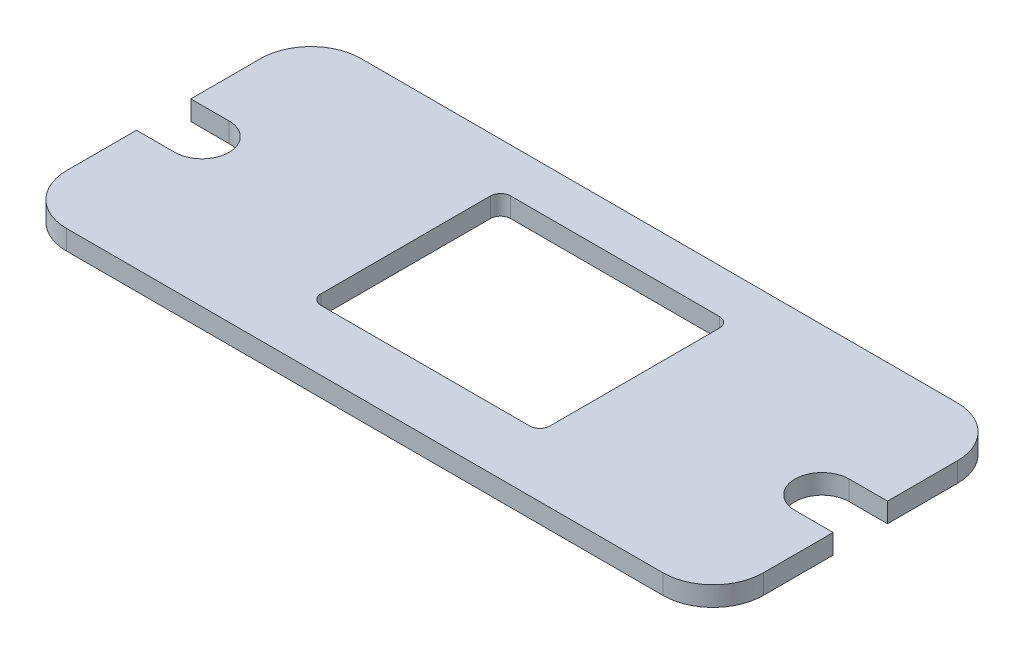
ISO-10303-21;
HEADER;
FILE_DESCRIPTION(('STEP AP214'),'2;1');
FILE_NAME('part.step','',(''),(''),'','','');
FILE_SCHEMA(('AUTOMOTIVE_DESIGN { 1 0 10303 214 1 1 1 1 }'));
ENDSEC;
DATA;
#1=APPLICATION_CONTEXT('core data for automotive mechanical design processes');
#2=APPLICATION_PROTOCOL_DEFINITION('international standard','automotive_design',2000,#1);
#3=PRODUCT_CONTEXT('',#1,'mechanical');
#4=PRODUCT('Part','Part','',(#3));
#5=PRODUCT_RELATED_PRODUCT_CATEGORY('part','',(#4));
#6=PRODUCT_DEFINITION_FORMATION('','',#4);
#7=PRODUCT_DEFINITION_CONTEXT('part definition',#1,'design');
#8=PRODUCT_DEFINITION('design','',#6,#7);
#9=PRODUCT_DEFINITION_SHAPE('','',#8);
#10=(LENGTH_UNIT() NAMED_UNIT(*) SI_UNIT(.MILLI.,.METRE.));
#11=(NAMED_UNIT(*) PLANE_ANGLE_UNIT() SI_UNIT($,.RADIAN.));
#12=(NAMED_UNIT(*) SI_UNIT($,.STERADIAN.) SOLID_ANGLE_UNIT());
#13=UNCERTAINTY_MEASURE_WITH_UNIT(LENGTH_MEASURE(1.E-05),#10,'distance_accuracy_value','');
#14=(GEOMETRIC_REPRESENTATION_CONTEXT(3) GLOBAL_UNCERTAINTY_ASSIGNED_CONTEXT((#13)) GLOBAL_UNIT_ASSIGNED_CONTEXT((#10,
#11,#12)) REPRESENTATION_CONTEXT('',''));
#15=CARTESIAN_POINT('',(0.,0.,0.));
#16=DIRECTION('',(0.,0.,1.));
#17=DIRECTION('',(1.,0.,0.));
#18=AXIS2_PLACEMENT_3D('',#15,#16,#17);
#19=CARTESIAN_POINT('',(27.051,1.52400000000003,-11.43));
#20=DIRECTION('',(-1.,0.,0.));
#21=DIRECTION('',(0.,0.,1.));
#22=AXIS2_PLACEMENT_3D('',#19,#20,#21);
#23=PLANE('',#22);
#24=DIRECTION('',(0.,0.,-1.));
#25=VECTOR('',#24,1.);
#26=CARTESIAN_POINT('',(27.051,0.,-11.43));
#27=LINE('',#26,#25);
#28=CARTESIAN_POINT('',(27.051,0.,-2.1082));
#29=VERTEX_POINT('',#28);
#30=CARTESIAN_POINT('',(27.051,0.,-7.5311));
#31=VERTEX_POINT('',#30);
#32=EDGE_CURVE('E269',#29,#31,#27,.T.);
#33=ORIENTED_EDGE('',*,*,#32,.T.);
#34=DIRECTION('',(0.,-1.,0.));
#35=VECTOR('',#34,1.);
#36=CARTESIAN_POINT('',(27.051,1.524,-7.5311));
#37=LINE('',#36,#35);
#38=CARTESIAN_POINT('',(27.051,1.524,-7.5311));
#39=VERTEX_POINT('',#38);
#40=EDGE_CURVE('E333',#31,#39,#37,.F.);
#41=ORIENTED_EDGE('',*,*,#40,.T.);
#42=DIRECTION('',(0.,0.,-1.));
#43=VECTOR('',#42,1.);
#44=CARTESIAN_POINT('',(27.051,1.52400000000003,-11.43));
#45=LINE('',#44,#43);
#46=CARTESIAN_POINT('',(27.051,1.524,-2.10819999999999));
#47=VERTEX_POINT('',#46);
#48=EDGE_CURVE('E279',#47,#39,#45,.T.);
#49=ORIENTED_EDGE('',*,*,#48,.F.);
#50=DIRECTION('',(0.,1.,0.));
#51=VECTOR('',#50,1.);
#52=CARTESIAN_POINT('',(27.051,0.,-2.1082));
#53=LINE('',#52,#51);
#54=EDGE_CURVE('E246',#29,#47,#53,.T.);
#55=ORIENTED_EDGE('',*,*,#54,.F.);
#56=EDGE_LOOP('',(#33,#41,#49,#55));
#57=FACE_BOUND('',#56,.T.);
#58=ADVANCED_FACE('F44',(#57),#23,.F.);
#59=CARTESIAN_POINT('',(-27.051,1.52400000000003,-11.43));
#60=DIRECTION('',(1.,0.,0.));
#61=DIRECTION('',(0.,0.,-1.));
#62=AXIS2_PLACEMENT_3D('',#59,#60,#61);
#63=PLANE('',#62);
#64=DIRECTION('',(0.,0.,1.));
#65=VECTOR('',#64,1.);
#66=CARTESIAN_POINT('',(-27.051,0.,-11.4300000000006));
#67=LINE('',#66,#65);
#68=CARTESIAN_POINT('',(-27.051,2.77555756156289E-13,2.10819999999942));
#69=VERTEX_POINT('',#68);
#70=CARTESIAN_POINT('',(-27.0510000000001,2.4980018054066E-13,7.53109999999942));
#71=VERTEX_POINT('',#70);
#72=EDGE_CURVE('E292',#69,#71,#67,.T.);
#73=ORIENTED_EDGE('',*,*,#72,.T.);
#74=DIRECTION('',(0.,-1.,0.));
#75=VECTOR('',#74,1.);
#76=CARTESIAN_POINT('',(-27.051,1.52400000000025,7.5311));
#77=LINE('',#76,#75);
#78=CARTESIAN_POINT('',(-27.051,1.52400000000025,7.5311));
#79=VERTEX_POINT('',#78);
#80=EDGE_CURVE('E313',#71,#79,#77,.F.);
#81=ORIENTED_EDGE('',*,*,#80,.T.);
#82=DIRECTION('',(0.,0.,1.));
#83=VECTOR('',#82,1.);
#84=CARTESIAN_POINT('',(-27.051,1.52400000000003,-11.43));
#85=LINE('',#84,#83);
#86=CARTESIAN_POINT('',(-27.0509999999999,1.52400000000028,2.1082));
#87=VERTEX_POINT('',#86);
#88=EDGE_CURVE('E281',#87,#79,#85,.T.);
#89=ORIENTED_EDGE('',*,*,#88,.F.);
#90=DIRECTION('',(0.,1.,0.));
#91=VECTOR('',#90,1.);
#92=CARTESIAN_POINT('',(-27.051,2.77555756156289E-13,2.10819999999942));
#93=LINE('',#92,#91);
#94=EDGE_CURVE('E270',#69,#87,#93,.T.);
#95=ORIENTED_EDGE('',*,*,#94,.F.);
#96=EDGE_LOOP('',(#73,#81,#89,#95));
#97=FACE_BOUND('',#96,.T.);
#98=ADVANCED_FACE('F425',(#97),#63,.F.);
#99=CARTESIAN_POINT('',(27.051,1.52400000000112,7.5311));
#100=VERTEX_POINT('',#99);
#101=CARTESIAN_POINT('',(27.051,1.5240000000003,2.1082));
#102=VERTEX_POINT('',#101);
#103=EDGE_CURVE('E276',#100,#102,#45,.T.);
#104=ORIENTED_EDGE('',*,*,#103,.F.);
#105=DIRECTION('',(0.,-1.,0.));
#106=VECTOR('',#105,1.);
#107=CARTESIAN_POINT('',(27.051,1.52400000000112,7.5311));
#108=LINE('',#107,#106);
#109=CARTESIAN_POINT('',(27.051,1.12410081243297E-12,7.5311));
#110=VERTEX_POINT('',#109);
#111=EDGE_CURVE('E317',#100,#110,#108,.T.);
#112=ORIENTED_EDGE('',*,*,#111,.T.);
#113=CARTESIAN_POINT('',(27.051,3.05311331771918E-13,2.1082));
#114=VERTEX_POINT('',#113);
#115=EDGE_CURVE('E288',#110,#114,#27,.T.);
#116=ORIENTED_EDGE('',*,*,#115,.T.);
#117=DIRECTION('',(0.,1.,0.));
#118=VECTOR('',#117,1.);
#119=CARTESIAN_POINT('',(27.051,3.05311331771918E-13,2.1082));
#120=LINE('',#119,#118);
#121=EDGE_CURVE('E217',#114,#102,#120,.T.);
#122=ORIENTED_EDGE('',*,*,#121,.T.);
#123=EDGE_LOOP('',(#104,#112,#116,#122));
#124=FACE_BOUND('',#123,.T.);
#125=ADVANCED_FACE('F428',(#124),#23,.F.);
#126=CARTESIAN_POINT('',(-27.051,1.52400000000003,-11.43));
#127=DIRECTION('',(0.,0.,1.));
#128=DIRECTION('',(1.,0.,0.));
#129=AXIS2_PLACEMENT_3D('',#126,#127,#128);
#130=PLANE('',#129);
#131=DIRECTION('',(-1.,0.,0.));
#132=VECTOR('',#131,1.);
#133=CARTESIAN_POINT('',(-27.051,1.52400000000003,-11.43));
#134=LINE('',#133,#132);
#135=CARTESIAN_POINT('',(23.1521,1.52400000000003,-11.43));
#136=VERTEX_POINT('',#135);
#137=CARTESIAN_POINT('',(-23.1521,1.52400000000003,-11.43));
#138=VERTEX_POINT('',#137);
#139=EDGE_CURVE('E278',#136,#138,#134,.T.);
#140=ORIENTED_EDGE('',*,*,#139,.F.);
#141=DIRECTION('',(0.,-1.,0.));
#142=VECTOR('',#141,1.);
#143=CARTESIAN_POINT('',(23.1521,1.52400000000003,-11.43));
#144=LINE('',#143,#142);
#145=CARTESIAN_POINT('',(23.1521,0.,-11.43));
#146=VERTEX_POINT('',#145);
#147=EDGE_CURVE('E330',#136,#146,#144,.T.);
#148=ORIENTED_EDGE('',*,*,#147,.T.);
#149=DIRECTION('',(-1.,0.,0.));
#150=VECTOR('',#149,1.);
#151=CARTESIAN_POINT('',(-27.051,0.,-11.4300000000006));
#152=LINE('',#151,#150);
#153=CARTESIAN_POINT('',(-23.1521,0.,-11.4300000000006));
#154=VERTEX_POINT('',#153);
#155=EDGE_CURVE('E290',#146,#154,#152,.T.);
#156=ORIENTED_EDGE('',*,*,#155,.T.);
#157=DIRECTION('',(0.,-1.,0.));
#158=VECTOR('',#157,1.);
#159=CARTESIAN_POINT('',(-23.1521,1.52400000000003,-11.43));
#160=LINE('',#159,#158);
#161=EDGE_CURVE('E303',#154,#138,#160,.F.);
#162=ORIENTED_EDGE('',*,*,#161,.T.);
#163=EDGE_LOOP('',(#140,#148,#156,#162));
#164=FACE_BOUND('',#163,.T.);
#165=ADVANCED_FACE('F439',(#164),#130,.F.);
#166=CARTESIAN_POINT('',(-27.051,1.524,-7.5311));
#167=VERTEX_POINT('',#166);
#168=CARTESIAN_POINT('',(-27.051,1.524,-2.10819999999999));
#169=VERTEX_POINT('',#168);
#170=EDGE_CURVE('E282',#167,#169,#85,.T.);
#171=ORIENTED_EDGE('',*,*,#170,.F.);
#172=DIRECTION('',(0.,-1.,0.));
#173=VECTOR('',#172,1.);
#174=CARTESIAN_POINT('',(-27.051,1.524,-7.5311));
#175=LINE('',#174,#173);
#176=CARTESIAN_POINT('',(-27.051,0.,-7.53110000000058));
#177=VERTEX_POINT('',#176);
#178=EDGE_CURVE('E287',#167,#177,#175,.T.);
#179=ORIENTED_EDGE('',*,*,#178,.T.);
#180=CARTESIAN_POINT('',(-27.0510000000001,0.,-2.10820000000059));
#181=VERTEX_POINT('',#180);
#182=EDGE_CURVE('E293',#177,#181,#67,.T.);
#183=ORIENTED_EDGE('',*,*,#182,.T.);
#184=DIRECTION('',(0.,1.,0.));
#185=VECTOR('',#184,1.);
#186=CARTESIAN_POINT('',(-27.0510000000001,0.,-2.10820000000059));
#187=LINE('',#186,#185);
#188=EDGE_CURVE('E272',#181,#169,#187,.T.);
#189=ORIENTED_EDGE('',*,*,#188,.T.);
#190=EDGE_LOOP('',(#171,#179,#183,#189));
#191=FACE_BOUND('',#190,.T.);
#192=ADVANCED_FACE('F434',(#191),#63,.F.);
#193=CARTESIAN_POINT('',(-27.051,1.52400000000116,11.43));
#194=DIRECTION('',(0.,0.,-1.));
#195=DIRECTION('',(-1.,0.,0.));
#196=AXIS2_PLACEMENT_3D('',#193,#194,#195);
#197=PLANE('',#196);
#198=DIRECTION('',(1.,0.,0.));
#199=VECTOR('',#198,1.);
#200=CARTESIAN_POINT('',(-27.0510000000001,1.16573417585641E-12,11.4299999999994));
#201=LINE('',#200,#199);
#202=CARTESIAN_POINT('',(-23.1521000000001,1.16573417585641E-12,11.4299999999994));
#203=VERTEX_POINT('',#202);
#204=CARTESIAN_POINT('',(23.1521,1.20736753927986E-12,11.43));
#205=VERTEX_POINT('',#204);
#206=EDGE_CURVE('E295',#203,#205,#201,.T.);
#207=ORIENTED_EDGE('',*,*,#206,.T.);
#208=DIRECTION('',(0.,-1.,0.));
#209=VECTOR('',#208,1.);
#210=CARTESIAN_POINT('',(23.1521,1.5240000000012,11.43));
#211=LINE('',#210,#209);
#212=CARTESIAN_POINT('',(23.1521,1.5240000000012,11.43));
#213=VERTEX_POINT('',#212);
#214=EDGE_CURVE('E324',#205,#213,#211,.F.);
#215=ORIENTED_EDGE('',*,*,#214,.T.);
#216=DIRECTION('',(1.,0.,0.));
#217=VECTOR('',#216,1.);
#218=CARTESIAN_POINT('',(-27.051,1.52400000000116,11.43));
#219=LINE('',#218,#217);
#220=CARTESIAN_POINT('',(-23.1521,1.52400000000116,11.43));
#221=VERTEX_POINT('',#220);
#222=EDGE_CURVE('E284',#221,#213,#219,.T.);
#223=ORIENTED_EDGE('',*,*,#222,.F.);
#224=DIRECTION('',(0.,-1.,0.));
#225=VECTOR('',#224,1.);
#226=CARTESIAN_POINT('',(-23.1521,1.52400000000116,11.43));
#227=LINE('',#226,#225);
#228=EDGE_CURVE('E308',#221,#203,#227,.T.);
#229=ORIENTED_EDGE('',*,*,#228,.T.);
#230=EDGE_LOOP('',(#207,#215,#223,#229));
#231=FACE_BOUND('',#230,.T.);
#232=ADVANCED_FACE('F453',(#231),#197,.F.);
#233=CARTESIAN_POINT('',(1.38777878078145E-13,1.524,0.));
#234=DIRECTION('',(0.,1.,0.));
#235=DIRECTION('',(0.,0.,1.));
#236=AXIS2_PLACEMENT_3D('',#233,#234,#235);
#237=PLANE('',#236);
#238=DIRECTION('',(0.,0.,-1.));
#239=VECTOR('',#238,1.);
#240=CARTESIAN_POINT('',(8.89,1.524,6.731));
#241=LINE('',#240,#239);
#242=CARTESIAN_POINT('',(8.89,1.524,5.94359999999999));
#243=VERTEX_POINT('',#242);
#244=CARTESIAN_POINT('',(8.89000000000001,1.524,-7.2136));
#245=VERTEX_POINT('',#244);
#246=EDGE_CURVE('E377',#243,#245,#241,.T.);
#247=ORIENTED_EDGE('',*,*,#246,.F.);
#248=CARTESIAN_POINT('',(8.1026,1.524,5.94359999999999));
#249=DIRECTION('',(0.,1.,0.));
#250=DIRECTION('',(0.,0.,1.));
#251=AXIS2_PLACEMENT_3D('',#248,#249,#250);
#252=CIRCLE('',#251,0.7874);
#253=CARTESIAN_POINT('',(8.1026,1.52400000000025,6.731));
#254=VERTEX_POINT('',#253);
#255=EDGE_CURVE('E354',#243,#254,#252,.F.);
#256=ORIENTED_EDGE('',*,*,#255,.T.);
#257=DIRECTION('',(1.,0.,0.));
#258=VECTOR('',#257,1.);
#259=CARTESIAN_POINT('',(-8.89,1.524,6.731));
#260=LINE('',#259,#258);
#261=CARTESIAN_POINT('',(-8.10259999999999,1.524,6.731));
#262=VERTEX_POINT('',#261);
#263=EDGE_CURVE('E236',#262,#254,#260,.T.);
#264=ORIENTED_EDGE('',*,*,#263,.F.);
#265=CARTESIAN_POINT('',(-8.10259999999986,1.52400000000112,5.94359999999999));
#266=DIRECTION('',(0.,1.,0.));
#267=DIRECTION('',(0.,0.,1.));
#268=AXIS2_PLACEMENT_3D('',#265,#266,#267);
#269=CIRCLE('',#268,0.7874);
#270=CARTESIAN_POINT('',(-8.88999999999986,1.524,5.94359999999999));
#271=VERTEX_POINT('',#270);
#272=EDGE_CURVE('E358',#262,#271,#269,.F.);
#273=ORIENTED_EDGE('',*,*,#272,.T.);
#274=DIRECTION('',(0.,0.,1.));
#275=VECTOR('',#274,1.);
#276=CARTESIAN_POINT('',(-8.89,1.524,6.731));
#277=LINE('',#276,#275);
#278=CARTESIAN_POINT('',(-8.89,1.52400000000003,-7.2136));
#279=VERTEX_POINT('',#278);
#280=EDGE_CURVE('E372',#279,#271,#277,.T.);
#281=ORIENTED_EDGE('',*,*,#280,.F.);
#282=CARTESIAN_POINT('',(-8.10259999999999,1.52400000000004,-7.2136));
#283=DIRECTION('',(0.,1.,0.));
#284=DIRECTION('',(0.,0.,1.));
#285=AXIS2_PLACEMENT_3D('',#282,#283,#284);
#286=CIRCLE('',#285,0.7874);
#287=CARTESIAN_POINT('',(-8.10259999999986,1.524,-8.00099999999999));
#288=VERTEX_POINT('',#287);
#289=EDGE_CURVE('E52',#279,#288,#286,.F.);
#290=ORIENTED_EDGE('',*,*,#289,.T.);
#291=DIRECTION('',(-1.,0.,0.));
#292=VECTOR('',#291,1.);
#293=CARTESIAN_POINT('',(-8.88999999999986,1.52400000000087,-8.00099999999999));
#294=LINE('',#293,#292);
#295=CARTESIAN_POINT('',(8.10259999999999,1.52400000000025,-8.00100000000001));
#296=VERTEX_POINT('',#295);
#297=EDGE_CURVE('E370',#296,#288,#294,.T.);
#298=ORIENTED_EDGE('',*,*,#297,.F.);
#299=CARTESIAN_POINT('',(8.10259999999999,1.524,-7.2136));
#300=DIRECTION('',(0.,1.,0.));
#301=DIRECTION('',(0.,0.,1.));
#302=AXIS2_PLACEMENT_3D('',#299,#300,#301);
#303=CIRCLE('',#302,0.7874);
#304=EDGE_CURVE('E362',#296,#245,#303,.F.);
#305=ORIENTED_EDGE('',*,*,#304,.T.);
#306=EDGE_LOOP('',(#247,#256,#264,#273,#281,#290,#298,#305));
#307=FACE_BOUND('',#306,.T.);
#308=ORIENTED_EDGE('',*,*,#222,.T.);
#309=CARTESIAN_POINT('',(23.1521,1.52400000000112,7.5311));
#310=DIRECTION('',(0.,1.,0.));
#311=DIRECTION('',(0.,0.,1.));
#312=AXIS2_PLACEMENT_3D('',#309,#310,#311);
#313=CIRCLE('',#312,3.8989);
#314=EDGE_CURVE('E328',#213,#100,#313,.T.);
#315=ORIENTED_EDGE('',*,*,#314,.T.);
#316=ORIENTED_EDGE('',*,*,#103,.T.);
#317=DIRECTION('',(1.,0.,0.));
#318=VECTOR('',#317,1.);
#319=CARTESIAN_POINT('',(24.0792,1.52400000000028,2.1082));
#320=LINE('',#319,#318);
#321=CARTESIAN_POINT('',(24.0792,1.52400000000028,2.1082));
#322=VERTEX_POINT('',#321);
#323=EDGE_CURVE('E233',#322,#102,#320,.T.);
#324=ORIENTED_EDGE('',*,*,#323,.F.);
#325=CARTESIAN_POINT('',(24.0792,1.52400000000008,0.));
#326=DIRECTION('',(0.,1.,0.));
#327=DIRECTION('',(0.,0.,1.));
#328=AXIS2_PLACEMENT_3D('',#325,#326,#327);
#329=CIRCLE('',#328,2.1082);
#330=CARTESIAN_POINT('',(24.0792,1.524,-2.10819999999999));
#331=VERTEX_POINT('',#330);
#332=EDGE_CURVE('E213',#331,#322,#329,.T.);
#333=ORIENTED_EDGE('',*,*,#332,.F.);
#334=DIRECTION('',(-1.,0.,0.));
#335=VECTOR('',#334,1.);
#336=CARTESIAN_POINT('',(24.0792,1.524,-2.10819999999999));
#337=LINE('',#336,#335);
#338=EDGE_CURVE('E230',#47,#331,#337,.T.);
#339=ORIENTED_EDGE('',*,*,#338,.F.);
#340=ORIENTED_EDGE('',*,*,#48,.T.);
#341=CARTESIAN_POINT('',(23.1521,1.524,-7.5311));
#342=DIRECTION('',(0.,1.,0.));
#343=DIRECTION('',(0.,0.,1.));
#344=AXIS2_PLACEMENT_3D('',#341,#342,#343);
#345=CIRCLE('',#344,3.8989);
#346=EDGE_CURVE('E326',#39,#136,#345,.T.);
#347=ORIENTED_EDGE('',*,*,#346,.T.);
#348=ORIENTED_EDGE('',*,*,#139,.T.);
#349=CARTESIAN_POINT('',(-23.1521,1.524,-7.53110000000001));
#350=DIRECTION('',(0.,1.,0.));
#351=DIRECTION('',(0.,0.,1.));
#352=AXIS2_PLACEMENT_3D('',#349,#350,#351);
#353=CIRCLE('',#352,3.8989);
#354=EDGE_CURVE('E306',#138,#167,#353,.T.);
#355=ORIENTED_EDGE('',*,*,#354,.T.);
#356=ORIENTED_EDGE('',*,*,#170,.T.);
#357=DIRECTION('',(-1.,0.,0.));
#358=VECTOR('',#357,1.);
#359=CARTESIAN_POINT('',(-24.0792,1.52400000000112,-2.10819999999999));
#360=LINE('',#359,#358);
#361=CARTESIAN_POINT('',(-24.0792,1.52400000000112,-2.10819999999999));
#362=VERTEX_POINT('',#361);
#363=EDGE_CURVE('E262',#362,#169,#360,.T.);
#364=ORIENTED_EDGE('',*,*,#363,.F.);
#365=CARTESIAN_POINT('',(-24.0791999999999,1.524,0.));
#366=DIRECTION('',(0.,1.,0.));
#367=DIRECTION('',(0.,0.,1.));
#368=AXIS2_PLACEMENT_3D('',#365,#366,#367);
#369=CIRCLE('',#368,2.1082);
#370=CARTESIAN_POINT('',(-24.0791999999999,1.52400000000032,2.1082));
#371=VERTEX_POINT('',#370);
#372=EDGE_CURVE('E245',#371,#362,#369,.T.);
#373=ORIENTED_EDGE('',*,*,#372,.F.);
#374=DIRECTION('',(1.,0.,0.));
#375=VECTOR('',#374,1.);
#376=CARTESIAN_POINT('',(-24.0791999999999,1.52400000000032,2.1082));
#377=LINE('',#376,#375);
#378=EDGE_CURVE('E253',#87,#371,#377,.T.);
#379=ORIENTED_EDGE('',*,*,#378,.F.);
#380=ORIENTED_EDGE('',*,*,#88,.T.);
#381=CARTESIAN_POINT('',(-23.1521,1.52400000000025,7.53109999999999));
#382=DIRECTION('',(0.,1.,0.));
#383=DIRECTION('',(0.,0.,1.));
#384=AXIS2_PLACEMENT_3D('',#381,#382,#383);
#385=CIRCLE('',#384,3.8989);
#386=EDGE_CURVE('E315',#79,#221,#385,.T.);
#387=ORIENTED_EDGE('',*,*,#386,.T.);
#388=EDGE_LOOP('',(#308,#315,#316,#324,#333,#339,#340,#347,#348,#355,#356,#364,#373,#379,#380,#387));
#389=FACE_BOUND('',#388,.T.);
#390=ADVANCED_FACE('F368',(#307,#389),#237,.T.);
#391=CARTESIAN_POINT('',(0.,0.,0.));
#392=DIRECTION('',(0.,1.,0.));
#393=DIRECTION('',(0.,0.,1.));
#394=AXIS2_PLACEMENT_3D('',#391,#392,#393);
#395=PLANE('',#394);
#396=DIRECTION('',(0.,0.,1.));
#397=VECTOR('',#396,1.);
#398=CARTESIAN_POINT('',(-8.89,0.,6.73099999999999));
#399=LINE('',#398,#397);
#400=CARTESIAN_POINT('',(-8.89,0.,-7.21360000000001));
#401=VERTEX_POINT('',#400);
#402=CARTESIAN_POINT('',(-8.89,0.,5.94359999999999));
#403=VERTEX_POINT('',#402);
#404=EDGE_CURVE('E382',#401,#403,#399,.T.);
#405=ORIENTED_EDGE('',*,*,#404,.T.);
#406=CARTESIAN_POINT('',(-8.1026,1.12410081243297E-12,5.94359999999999));
#407=DIRECTION('',(0.,1.,0.));
#408=DIRECTION('',(0.,0.,1.));
#409=AXIS2_PLACEMENT_3D('',#406,#407,#408);
#410=CIRCLE('',#409,0.7874);
#411=CARTESIAN_POINT('',(-8.1026,0.,6.73099999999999));
#412=VERTEX_POINT('',#411);
#413=EDGE_CURVE('E360',#403,#412,#410,.T.);
#414=ORIENTED_EDGE('',*,*,#413,.T.);
#415=DIRECTION('',(1.,0.,0.));
#416=VECTOR('',#415,1.);
#417=CARTESIAN_POINT('',(-8.89,0.,6.73099999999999));
#418=LINE('',#417,#416);
#419=CARTESIAN_POINT('',(8.1026,2.4980018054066E-13,6.73099999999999));
#420=VERTEX_POINT('',#419);
#421=EDGE_CURVE('E241',#412,#420,#418,.T.);
#422=ORIENTED_EDGE('',*,*,#421,.T.);
#423=CARTESIAN_POINT('',(8.1026,0.,5.94359999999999));
#424=DIRECTION('',(0.,1.,0.));
#425=DIRECTION('',(0.,0.,1.));
#426=AXIS2_PLACEMENT_3D('',#423,#424,#425);
#427=CIRCLE('',#426,0.7874);
#428=CARTESIAN_POINT('',(8.89,0.,5.94359999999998));
#429=VERTEX_POINT('',#428);
#430=EDGE_CURVE('E356',#420,#429,#427,.T.);
#431=ORIENTED_EDGE('',*,*,#430,.T.);
#432=DIRECTION('',(0.,0.,-1.));
#433=VECTOR('',#432,1.);
#434=CARTESIAN_POINT('',(8.89,0.,6.73099999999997));
#435=LINE('',#434,#433);
#436=CARTESIAN_POINT('',(8.89000000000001,0.,-7.21360000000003));
#437=VERTEX_POINT('',#436);
#438=EDGE_CURVE('E391',#429,#437,#435,.T.);
#439=ORIENTED_EDGE('',*,*,#438,.T.);
#440=CARTESIAN_POINT('',(8.10259999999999,0.,-7.21360000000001));
#441=DIRECTION('',(0.,1.,0.));
#442=DIRECTION('',(0.,0.,1.));
#443=AXIS2_PLACEMENT_3D('',#440,#441,#442);
#444=CIRCLE('',#443,0.7874);
#445=CARTESIAN_POINT('',(8.10259999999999,2.4980018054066E-13,-8.00100000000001));
#446=VERTEX_POINT('',#445);
#447=EDGE_CURVE('E66',#437,#446,#444,.T.);
#448=ORIENTED_EDGE('',*,*,#447,.T.);
#449=DIRECTION('',(-1.,0.,0.));
#450=VECTOR('',#449,1.);
#451=CARTESIAN_POINT('',(-8.89,1.12410081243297E-12,-8.00100000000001));
#452=LINE('',#451,#450);
#453=CARTESIAN_POINT('',(-8.10259999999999,0.,-8.00100000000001));
#454=VERTEX_POINT('',#453);
#455=EDGE_CURVE('E384',#446,#454,#452,.T.);
#456=ORIENTED_EDGE('',*,*,#455,.T.);
#457=CARTESIAN_POINT('',(-8.1026,0.,-7.2136));
#458=DIRECTION('',(0.,1.,0.));
#459=DIRECTION('',(0.,0.,1.));
#460=AXIS2_PLACEMENT_3D('',#457,#458,#459);
#461=CIRCLE('',#460,0.7874);
#462=EDGE_CURVE('E13',#454,#401,#461,.T.);
#463=ORIENTED_EDGE('',*,*,#462,.T.);
#464=EDGE_LOOP('',(#405,#414,#422,#431,#439,#448,#456,#463));
#465=FACE_BOUND('',#464,.T.);
#466=ORIENTED_EDGE('',*,*,#115,.F.);
#467=CARTESIAN_POINT('',(23.1521,1.12410081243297E-12,7.5311));
#468=DIRECTION('',(0.,1.,0.));
#469=DIRECTION('',(0.,0.,1.));
#470=AXIS2_PLACEMENT_3D('',#467,#468,#469);
#471=CIRCLE('',#470,3.8989);
#472=EDGE_CURVE('E322',#110,#205,#471,.F.);
#473=ORIENTED_EDGE('',*,*,#472,.T.);
#474=ORIENTED_EDGE('',*,*,#206,.F.);
#475=CARTESIAN_POINT('',(-23.1521000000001,2.4980018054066E-13,7.53109999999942));
#476=DIRECTION('',(0.,1.,0.));
#477=DIRECTION('',(0.,0.,1.));
#478=AXIS2_PLACEMENT_3D('',#475,#476,#477);
#479=CIRCLE('',#478,3.8989);
#480=EDGE_CURVE('E311',#203,#71,#479,.F.);
#481=ORIENTED_EDGE('',*,*,#480,.T.);
#482=ORIENTED_EDGE('',*,*,#72,.F.);
#483=DIRECTION('',(1.,0.,0.));
#484=VECTOR('',#483,1.);
#485=CARTESIAN_POINT('',(-24.0792,3.19189119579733E-13,2.1082));
#486=LINE('',#485,#484);
#487=CARTESIAN_POINT('',(-24.0792,3.19189119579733E-13,2.1082));
#488=VERTEX_POINT('',#487);
#489=EDGE_CURVE('E256',#69,#488,#486,.T.);
#490=ORIENTED_EDGE('',*,*,#489,.T.);
#491=CARTESIAN_POINT('',(-24.0791999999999,0.,0.));
#492=DIRECTION('',(0.,1.,0.));
#493=DIRECTION('',(0.,0.,1.));
#494=AXIS2_PLACEMENT_3D('',#491,#492,#493);
#495=CIRCLE('',#494,2.1082);
#496=CARTESIAN_POINT('',(-24.0792000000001,1.12410081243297E-12,-2.1082));
#497=VERTEX_POINT('',#496);
#498=EDGE_CURVE('E249',#488,#497,#495,.T.);
#499=ORIENTED_EDGE('',*,*,#498,.T.);
#500=DIRECTION('',(-1.,0.,0.));
#501=VECTOR('',#500,1.);
#502=CARTESIAN_POINT('',(-24.0792000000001,1.12410081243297E-12,-2.1082));
#503=LINE('',#502,#501);
#504=EDGE_CURVE('E252',#497,#181,#503,.T.);
#505=ORIENTED_EDGE('',*,*,#504,.T.);
#506=ORIENTED_EDGE('',*,*,#182,.F.);
#507=CARTESIAN_POINT('',(-23.1521,0.,-7.53110000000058));
#508=DIRECTION('',(0.,1.,0.));
#509=DIRECTION('',(0.,0.,1.));
#510=AXIS2_PLACEMENT_3D('',#507,#508,#509);
#511=CIRCLE('',#510,3.8989);
#512=EDGE_CURVE('E300',#177,#154,#511,.F.);
#513=ORIENTED_EDGE('',*,*,#512,.T.);
#514=ORIENTED_EDGE('',*,*,#155,.F.);
#515=CARTESIAN_POINT('',(23.1521,0.,-7.5311));
#516=DIRECTION('',(0.,1.,0.));
#517=DIRECTION('',(0.,0.,1.));
#518=AXIS2_PLACEMENT_3D('',#515,#516,#517);
#519=CIRCLE('',#518,3.8989);
#520=EDGE_CURVE('E320',#146,#31,#519,.F.);
#521=ORIENTED_EDGE('',*,*,#520,.T.);
#522=ORIENTED_EDGE('',*,*,#32,.F.);
#523=DIRECTION('',(-1.,0.,0.));
#524=VECTOR('',#523,1.);
#525=CARTESIAN_POINT('',(24.0792,0.,-2.1082));
#526=LINE('',#525,#524);
#527=CARTESIAN_POINT('',(24.0792,0.,-2.1082));
#528=VERTEX_POINT('',#527);
#529=EDGE_CURVE('E218',#29,#528,#526,.T.);
#530=ORIENTED_EDGE('',*,*,#529,.T.);
#531=CARTESIAN_POINT('',(24.0792,0.,0.));
#532=DIRECTION('',(0.,1.,0.));
#533=DIRECTION('',(0.,0.,1.));
#534=AXIS2_PLACEMENT_3D('',#531,#532,#533);
#535=CIRCLE('',#534,2.1082);
#536=CARTESIAN_POINT('',(24.0792,2.77555756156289E-13,2.1082));
#537=VERTEX_POINT('',#536);
#538=EDGE_CURVE('E210',#528,#537,#535,.T.);
#539=ORIENTED_EDGE('',*,*,#538,.T.);
#540=DIRECTION('',(1.,0.,0.));
#541=VECTOR('',#540,1.);
#542=CARTESIAN_POINT('',(24.0792,2.77555756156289E-13,2.1082));
#543=LINE('',#542,#541);
#544=EDGE_CURVE('E222',#537,#114,#543,.T.);
#545=ORIENTED_EDGE('',*,*,#544,.T.);
#546=EDGE_LOOP('',(#466,#473,#474,#481,#482,#490,#499,#505,#506,#513,#514,#521,#522,#530,#539,#545));
#547=FACE_BOUND('',#546,.T.);
#548=ADVANCED_FACE('F228',(#465,#547),#395,.F.);
#549=CARTESIAN_POINT('',(-24.0791999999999,0.,0.));
#550=DIRECTION('',(0.,1.,0.));
#551=DIRECTION('',(0.,0.,1.));
#552=AXIS2_PLACEMENT_3D('',#549,#550,#551);
#553=CYLINDRICAL_SURFACE('',#552,2.1082);
#554=ORIENTED_EDGE('',*,*,#372,.T.);
#555=DIRECTION('',(0.,1.,0.));
#556=VECTOR('',#555,1.);
#557=CARTESIAN_POINT('',(-24.0792000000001,1.12410081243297E-12,-2.1082));
#558=LINE('',#557,#556);
#559=EDGE_CURVE('E259',#497,#362,#558,.T.);
#560=ORIENTED_EDGE('',*,*,#559,.F.);
#561=ORIENTED_EDGE('',*,*,#498,.F.);
#562=DIRECTION('',(0.,1.,0.));
#563=VECTOR('',#562,1.);
#564=CARTESIAN_POINT('',(-24.0792,3.19189119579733E-13,2.1082));
#565=LINE('',#564,#563);
#566=EDGE_CURVE('E267',#488,#371,#565,.T.);
#567=ORIENTED_EDGE('',*,*,#566,.T.);
#568=EDGE_LOOP('',(#554,#560,#561,#567));
#569=FACE_BOUND('',#568,.T.);
#570=ADVANCED_FACE('F471',(#569),#553,.F.);
#571=CARTESIAN_POINT('',(-24.0792,3.19189119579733E-13,2.1082));
#572=DIRECTION('',(0.,0.,1.));
#573=DIRECTION('',(1.,0.,0.));
#574=AXIS2_PLACEMENT_3D('',#571,#572,#573);
#575=PLANE('',#574);
#576=ORIENTED_EDGE('',*,*,#378,.T.);
#577=ORIENTED_EDGE('',*,*,#566,.F.);
#578=ORIENTED_EDGE('',*,*,#489,.F.);
#579=ORIENTED_EDGE('',*,*,#94,.T.);
#580=EDGE_LOOP('',(#576,#577,#578,#579));
#581=FACE_BOUND('',#580,.T.);
#582=ADVANCED_FACE('F467',(#581),#575,.F.);
#583=CARTESIAN_POINT('',(-24.0792000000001,1.12410081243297E-12,-2.1082));
#584=DIRECTION('',(0.,0.,-1.));
#585=DIRECTION('',(-1.,0.,0.));
#586=AXIS2_PLACEMENT_3D('',#583,#584,#585);
#587=PLANE('',#586);
#588=ORIENTED_EDGE('',*,*,#363,.T.);
#589=ORIENTED_EDGE('',*,*,#188,.F.);
#590=ORIENTED_EDGE('',*,*,#504,.F.);
#591=ORIENTED_EDGE('',*,*,#559,.T.);
#592=EDGE_LOOP('',(#588,#589,#590,#591));
#593=FACE_BOUND('',#592,.T.);
#594=ADVANCED_FACE('F477',(#593),#587,.F.);
#595=CARTESIAN_POINT('',(24.0792,0.,0.));
#596=DIRECTION('',(0.,1.,0.));
#597=DIRECTION('',(0.,0.,1.));
#598=AXIS2_PLACEMENT_3D('',#595,#596,#597);
#599=CYLINDRICAL_SURFACE('',#598,2.1082);
#600=ORIENTED_EDGE('',*,*,#332,.T.);
#601=DIRECTION('',(0.,1.,0.));
#602=VECTOR('',#601,1.);
#603=CARTESIAN_POINT('',(24.0792,2.77555756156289E-13,2.1082));
#604=LINE('',#603,#602);
#605=EDGE_CURVE('E206',#537,#322,#604,.T.);
#606=ORIENTED_EDGE('',*,*,#605,.F.);
#607=ORIENTED_EDGE('',*,*,#538,.F.);
#608=DIRECTION('',(0.,1.,0.));
#609=VECTOR('',#608,1.);
#610=CARTESIAN_POINT('',(24.0792,0.,-2.1082));
#611=LINE('',#610,#609);
#612=EDGE_CURVE('E243',#528,#331,#611,.T.);
#613=ORIENTED_EDGE('',*,*,#612,.T.);
#614=EDGE_LOOP('',(#600,#606,#607,#613));
#615=FACE_BOUND('',#614,.T.);
#616=ADVANCED_FACE('F208',(#615),#599,.F.);
#617=CARTESIAN_POINT('',(24.0792,0.,-2.1082));
#618=DIRECTION('',(0.,0.,-1.));
#619=DIRECTION('',(-1.,0.,0.));
#620=AXIS2_PLACEMENT_3D('',#617,#618,#619);
#621=PLANE('',#620);
#622=ORIENTED_EDGE('',*,*,#338,.T.);
#623=ORIENTED_EDGE('',*,*,#612,.F.);
#624=ORIENTED_EDGE('',*,*,#529,.F.);
#625=ORIENTED_EDGE('',*,*,#54,.T.);
#626=EDGE_LOOP('',(#622,#623,#624,#625));
#627=FACE_BOUND('',#626,.T.);
#628=ADVANCED_FACE('F496',(#627),#621,.F.);
#629=CARTESIAN_POINT('',(24.0792,2.77555756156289E-13,2.1082));
#630=DIRECTION('',(0.,0.,1.));
#631=DIRECTION('',(1.,0.,0.));
#632=AXIS2_PLACEMENT_3D('',#629,#630,#631);
#633=PLANE('',#632);
#634=ORIENTED_EDGE('',*,*,#323,.T.);
#635=ORIENTED_EDGE('',*,*,#121,.F.);
#636=ORIENTED_EDGE('',*,*,#544,.F.);
#637=ORIENTED_EDGE('',*,*,#605,.T.);
#638=EDGE_LOOP('',(#634,#635,#636,#637));
#639=FACE_BOUND('',#638,.T.);
#640=ADVANCED_FACE('F223',(#639),#633,.F.);
#641=CARTESIAN_POINT('',(-23.1521,1.524,-7.53110000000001));
#642=DIRECTION('',(0.,-1.,0.));
#643=DIRECTION('',(0.,0.,-1.));
#644=AXIS2_PLACEMENT_3D('',#641,#642,#643);
#645=CYLINDRICAL_SURFACE('',#644,3.8989);
#646=ORIENTED_EDGE('',*,*,#354,.F.);
#647=ORIENTED_EDGE('',*,*,#161,.F.);
#648=ORIENTED_EDGE('',*,*,#512,.F.);
#649=ORIENTED_EDGE('',*,*,#178,.F.);
#650=EDGE_LOOP('',(#646,#647,#648,#649));
#651=FACE_BOUND('',#650,.T.);
#652=ADVANCED_FACE('F483',(#651),#645,.T.);
#653=CARTESIAN_POINT('',(-23.1521,1.52400000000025,7.53109999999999));
#654=DIRECTION('',(0.,-1.,0.));
#655=DIRECTION('',(0.,0.,-1.));
#656=AXIS2_PLACEMENT_3D('',#653,#654,#655);
#657=CYLINDRICAL_SURFACE('',#656,3.8989);
#658=ORIENTED_EDGE('',*,*,#386,.F.);
#659=ORIENTED_EDGE('',*,*,#80,.F.);
#660=ORIENTED_EDGE('',*,*,#480,.F.);
#661=ORIENTED_EDGE('',*,*,#228,.F.);
#662=EDGE_LOOP('',(#658,#659,#660,#661));
#663=FACE_BOUND('',#662,.T.);
#664=ADVANCED_FACE('F458',(#663),#657,.T.);
#665=CARTESIAN_POINT('',(23.1521,1.52400000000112,7.5311));
#666=DIRECTION('',(0.,-1.,0.));
#667=DIRECTION('',(0.,0.,-1.));
#668=AXIS2_PLACEMENT_3D('',#665,#666,#667);
#669=CYLINDRICAL_SURFACE('',#668,3.8989);
#670=ORIENTED_EDGE('',*,*,#314,.F.);
#671=ORIENTED_EDGE('',*,*,#214,.F.);
#672=ORIENTED_EDGE('',*,*,#472,.F.);
#673=ORIENTED_EDGE('',*,*,#111,.F.);
#674=EDGE_LOOP('',(#670,#671,#672,#673));
#675=FACE_BOUND('',#674,.T.);
#676=ADVANCED_FACE('F449',(#675),#669,.T.);
#677=CARTESIAN_POINT('',(23.1521,1.524,-7.5311));
#678=DIRECTION('',(0.,-1.,0.));
#679=DIRECTION('',(0.,0.,-1.));
#680=AXIS2_PLACEMENT_3D('',#677,#678,#679);
#681=CYLINDRICAL_SURFACE('',#680,3.8989);
#682=ORIENTED_EDGE('',*,*,#346,.F.);
#683=ORIENTED_EDGE('',*,*,#40,.F.);
#684=ORIENTED_EDGE('',*,*,#520,.F.);
#685=ORIENTED_EDGE('',*,*,#147,.F.);
#686=EDGE_LOOP('',(#682,#683,#684,#685));
#687=FACE_BOUND('',#686,.T.);
#688=ADVANCED_FACE('F422',(#687),#681,.T.);
#689=CARTESIAN_POINT('',(8.89,0.,6.73099999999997));
#690=DIRECTION('',(1.,0.,0.));
#691=DIRECTION('',(0.,0.,-1.));
#692=AXIS2_PLACEMENT_3D('',#689,#690,#691);
#693=PLANE('',#692);
#694=ORIENTED_EDGE('',*,*,#438,.F.);
#695=DIRECTION('',(0.,1.,0.));
#696=VECTOR('',#695,1.);
#697=CARTESIAN_POINT('',(8.89,1.524,5.94359999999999));
#698=LINE('',#697,#696);
#699=EDGE_CURVE('E337',#429,#243,#698,.T.);
#700=ORIENTED_EDGE('',*,*,#699,.T.);
#701=ORIENTED_EDGE('',*,*,#246,.T.);
#702=DIRECTION('',(0.,1.,0.));
#703=VECTOR('',#702,1.);
#704=CARTESIAN_POINT('',(8.89000000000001,0.,-7.21360000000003));
#705=LINE('',#704,#703);
#706=EDGE_CURVE('E335',#245,#437,#705,.F.);
#707=ORIENTED_EDGE('',*,*,#706,.T.);
#708=EDGE_LOOP('',(#694,#700,#701,#707));
#709=FACE_BOUND('',#708,.T.);
#710=ADVANCED_FACE('F407',(#709),#693,.F.);
#711=CARTESIAN_POINT('',(-8.89,0.,6.73099999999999));
#712=DIRECTION('',(0.,0.,1.));
#713=DIRECTION('',(1.,0.,0.));
#714=AXIS2_PLACEMENT_3D('',#711,#712,#713);
#715=PLANE('',#714);
#716=ORIENTED_EDGE('',*,*,#263,.T.);
#717=DIRECTION('',(0.,1.,0.));
#718=VECTOR('',#717,1.);
#719=CARTESIAN_POINT('',(8.1026,2.4980018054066E-13,6.73099999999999));
#720=LINE('',#719,#718);
#721=EDGE_CURVE('E343',#254,#420,#720,.F.);
#722=ORIENTED_EDGE('',*,*,#721,.T.);
#723=ORIENTED_EDGE('',*,*,#421,.F.);
#724=DIRECTION('',(0.,1.,0.));
#725=VECTOR('',#724,1.);
#726=CARTESIAN_POINT('',(-8.10259999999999,1.524,6.731));
#727=LINE('',#726,#725);
#728=EDGE_CURVE('E340',#412,#262,#727,.T.);
#729=ORIENTED_EDGE('',*,*,#728,.T.);
#730=EDGE_LOOP('',(#716,#722,#723,#729));
#731=FACE_BOUND('',#730,.T.);
#732=ADVANCED_FACE('F414',(#731),#715,.F.);
#733=CARTESIAN_POINT('',(-8.89,0.,6.73099999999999));
#734=DIRECTION('',(-1.,0.,0.));
#735=DIRECTION('',(0.,0.,1.));
#736=AXIS2_PLACEMENT_3D('',#733,#734,#735);
#737=PLANE('',#736);
#738=ORIENTED_EDGE('',*,*,#280,.T.);
#739=DIRECTION('',(0.,1.,0.));
#740=VECTOR('',#739,1.);
#741=CARTESIAN_POINT('',(-8.89,0.,5.94359999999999));
#742=LINE('',#741,#740);
#743=EDGE_CURVE('E348',#271,#403,#742,.F.);
#744=ORIENTED_EDGE('',*,*,#743,.T.);
#745=ORIENTED_EDGE('',*,*,#404,.F.);
#746=DIRECTION('',(0.,1.,0.));
#747=VECTOR('',#746,1.);
#748=CARTESIAN_POINT('',(-8.89,1.52400000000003,-7.2136));
#749=LINE('',#748,#747);
#750=EDGE_CURVE('E345',#401,#279,#749,.T.);
#751=ORIENTED_EDGE('',*,*,#750,.T.);
#752=EDGE_LOOP('',(#738,#744,#745,#751));
#753=FACE_BOUND('',#752,.T.);
#754=ADVANCED_FACE('F386',(#753),#737,.F.);
#755=CARTESIAN_POINT('',(-8.89,1.12410081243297E-12,-8.00100000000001));
#756=DIRECTION('',(0.,0.,-1.));
#757=DIRECTION('',(-1.,0.,0.));
#758=AXIS2_PLACEMENT_3D('',#755,#756,#757);
#759=PLANE('',#758);
#760=ORIENTED_EDGE('',*,*,#455,.F.);
#761=DIRECTION('',(0.,1.,0.));
#762=VECTOR('',#761,1.);
#763=CARTESIAN_POINT('',(8.10259999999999,1.52400000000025,-8.00100000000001));
#764=LINE('',#763,#762);
#765=EDGE_CURVE('E351',#446,#296,#764,.T.);
#766=ORIENTED_EDGE('',*,*,#765,.T.);
#767=ORIENTED_EDGE('',*,*,#297,.T.);
#768=DIRECTION('',(0.,1.,0.));
#769=VECTOR('',#768,1.);
#770=CARTESIAN_POINT('',(-8.10259999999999,0.,-8.00100000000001));
#771=LINE('',#770,#769);
#772=EDGE_CURVE('E59',#288,#454,#771,.F.);
#773=ORIENTED_EDGE('',*,*,#772,.T.);
#774=EDGE_LOOP('',(#760,#766,#767,#773));
#775=FACE_BOUND('',#774,.T.);
#776=ADVANCED_FACE('F375',(#775),#759,.F.);
#777=CARTESIAN_POINT('',(8.1026,0.,5.94359999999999));
#778=DIRECTION('',(0.,-1.,0.));
#779=DIRECTION('',(0.,0.,-1.));
#780=AXIS2_PLACEMENT_3D('',#777,#778,#779);
#781=CYLINDRICAL_SURFACE('',#780,0.7874);
#782=ORIENTED_EDGE('',*,*,#430,.F.);
#783=ORIENTED_EDGE('',*,*,#721,.F.);
#784=ORIENTED_EDGE('',*,*,#255,.F.);
#785=ORIENTED_EDGE('',*,*,#699,.F.);
#786=EDGE_LOOP('',(#782,#783,#784,#785));
#787=FACE_BOUND('',#786,.T.);
#788=ADVANCED_FACE('F409',(#787),#781,.F.);
#789=CARTESIAN_POINT('',(-8.1026,1.12410081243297E-12,5.94359999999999));
#790=DIRECTION('',(0.,-1.,0.));
#791=DIRECTION('',(0.,0.,-1.));
#792=AXIS2_PLACEMENT_3D('',#789,#790,#791);
#793=CYLINDRICAL_SURFACE('',#792,0.7874);
#794=ORIENTED_EDGE('',*,*,#413,.F.);
#795=ORIENTED_EDGE('',*,*,#743,.F.);
#796=ORIENTED_EDGE('',*,*,#272,.F.);
#797=ORIENTED_EDGE('',*,*,#728,.F.);
#798=EDGE_LOOP('',(#794,#795,#796,#797));
#799=FACE_BOUND('',#798,.T.);
#800=ADVANCED_FACE('F412',(#799),#793,.F.);
#801=CARTESIAN_POINT('',(8.10259999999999,0.,-7.21360000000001));
#802=DIRECTION('',(0.,-1.,0.));
#803=DIRECTION('',(0.,0.,-1.));
#804=AXIS2_PLACEMENT_3D('',#801,#802,#803);
#805=CYLINDRICAL_SURFACE('',#804,0.7874);
#806=ORIENTED_EDGE('',*,*,#447,.F.);
#807=ORIENTED_EDGE('',*,*,#706,.F.);
#808=ORIENTED_EDGE('',*,*,#304,.F.);
#809=ORIENTED_EDGE('',*,*,#765,.F.);
#810=EDGE_LOOP('',(#806,#807,#808,#809));
#811=FACE_BOUND('',#810,.T.);
#812=ADVANCED_FACE('F406',(#811),#805,.F.);
#813=CARTESIAN_POINT('',(-8.1026,0.,-7.2136));
#814=DIRECTION('',(0.,-1.,0.));
#815=DIRECTION('',(0.,0.,-1.));
#816=AXIS2_PLACEMENT_3D('',#813,#814,#815);
#817=CYLINDRICAL_SURFACE('',#816,0.7874);
#818=ORIENTED_EDGE('',*,*,#462,.F.);
#819=ORIENTED_EDGE('',*,*,#772,.F.);
#820=ORIENTED_EDGE('',*,*,#289,.F.);
#821=ORIENTED_EDGE('',*,*,#750,.F.);
#822=EDGE_LOOP('',(#818,#819,#820,#821));
#823=FACE_BOUND('',#822,.T.);
#824=ADVANCED_FACE('F46',(#823),#817,.F.);
#825=CLOSED_SHELL('',(#58,#98,#125,#165,#192,#232,#390,#548,#570,#582,#594,#616,#628,#640,#652,
#664,#676,#688,#710,#732,#754,#776,#788,#800,#812,#824));
#826=MANIFOLD_SOLID_BREP('B2',#825);
#827=ADVANCED_BREP_SHAPE_REPRESENTATION('',(#18,#826),#14);
#828=SHAPE_DEFINITION_REPRESENTATION(#9,#827);
ENDSEC;
END-ISO-10303-21;
